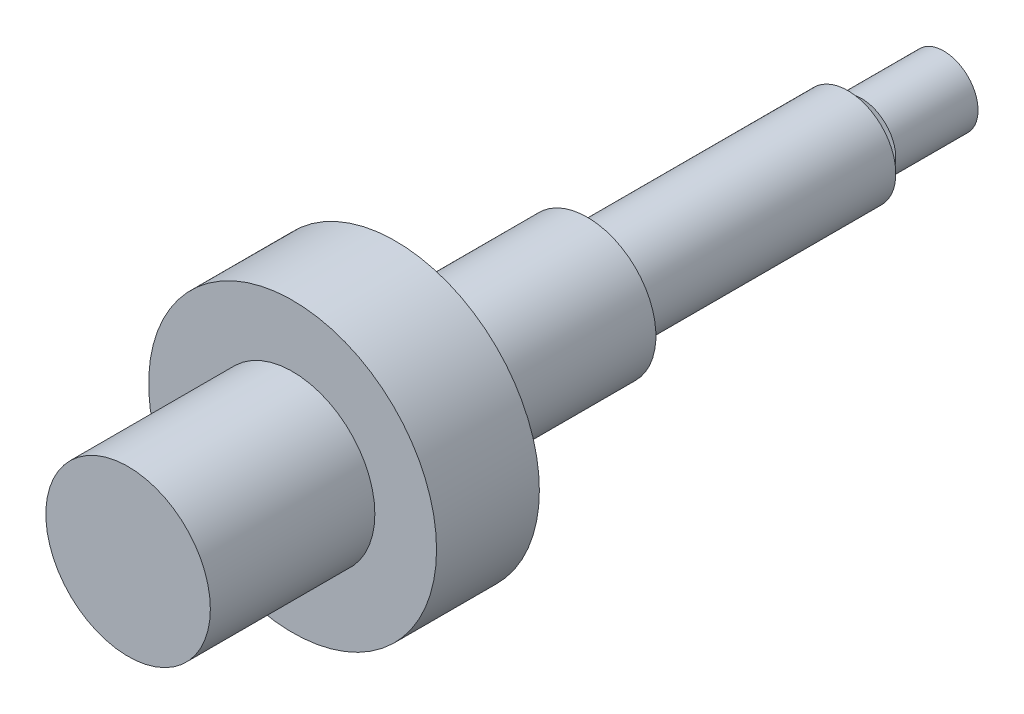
from build123d import *

# Parameters (mm, degrees)
SKETCH_1_R      = 10.5
EXTRUDE_1_DEPTH = 7.5
SKETCH_2_R      = 6
EXTRUDE_2_DEPTH = 12
SKETCH_3_R      = 4.5
EXTRUDE_3_DEPTH = 1
SKETCH_4_R      = 5
EXTRUDE_4_DEPTH = 13
SKETCH_5_R      = 2.5
EXTRUDE_5_DEPTH = 1
SKETCH_6_R      = 3.5
EXTRUDE_6_DEPTH = 18
SKETCH_7_R      = 1.5
EXTRUDE_7_DEPTH = 1
SKETCH_8_R      = 2.5
EXTRUDE_8_DEPTH = 6


with BuildPart() as part:
    # Sketch 1 → Extrude 1 (new body)
    with BuildSketch(Plane.XY):
        Circle(SKETCH_1_R)
    extrude(amount=EXTRUDE_1_DEPTH)

    # Sketch 2 → Extrude 2 (add)
    with BuildSketch(Plane.XY.offset(7.5)):
        Circle(SKETCH_2_R)
    extrude(amount=EXTRUDE_2_DEPTH)

    # Sketch 3 → Extrude 3 (add)
    with BuildSketch(Plane(origin=(0, 0, 0), x_dir=(-1, 0, 0), z_dir=(0, 0, -1))):
        with Locations(Location((0, 0, 0), (0, 0, 180))):
            Circle(SKETCH_3_R)
    extrude(amount=EXTRUDE_3_DEPTH)

    # Sketch 4 → Extrude 4 (add)
    with BuildSketch(Plane(origin=(0, 0, -1), x_dir=(-1, 0, 0), z_dir=(0, 0, -1))):
        Circle(SKETCH_4_R)
    extrude(amount=EXTRUDE_4_DEPTH)

    # Sketch 5 → Extrude 5 (add)
    with BuildSketch(Plane(origin=(0, 0, -14), x_dir=(-1, 0, 0), z_dir=(0, 0, -1))):
        Circle(SKETCH_5_R)
    extrude(amount=EXTRUDE_5_DEPTH)

    # Sketch 6 → Extrude 6 (add)
    with BuildSketch(Plane(origin=(0, 0, -15), x_dir=(-1, 0, 0), z_dir=(0, 0, -1))):
        Circle(SKETCH_6_R)
    extrude(amount=EXTRUDE_6_DEPTH)

    # Sketch 7 → Extrude 7 (add)
    with BuildSketch(Plane(origin=(0, 0, -33), x_dir=(-1, 0, 0), z_dir=(0, 0, -1))):
        Circle(SKETCH_7_R)
    extrude(amount=EXTRUDE_7_DEPTH)

    # Sketch 8 → Extrude 8 (add)
    with BuildSketch(Plane(origin=(0, 0, -34), x_dir=(-1, 0, 0), z_dir=(0, 0, -1))):
        Circle(SKETCH_8_R)
    extrude(amount=EXTRUDE_8_DEPTH)


solid = part.part
